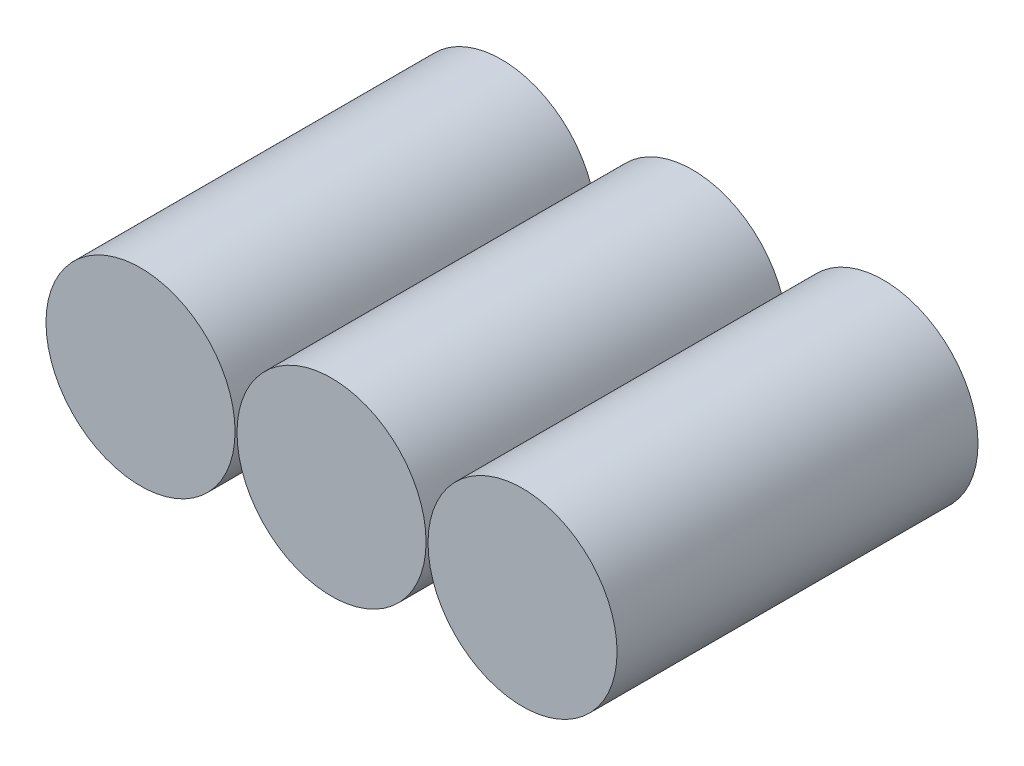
ISO-10303-21;
HEADER;
FILE_DESCRIPTION(('STEP AP214'),'2;1');
FILE_NAME('part.step','',(''),(''),'','','');
FILE_SCHEMA(('AUTOMOTIVE_DESIGN { 1 0 10303 214 1 1 1 1 }'));
ENDSEC;
DATA;
#1=APPLICATION_CONTEXT('core data for automotive mechanical design processes');
#2=APPLICATION_PROTOCOL_DEFINITION('international standard','automotive_design',2000,#1);
#3=PRODUCT_CONTEXT('',#1,'mechanical');
#4=PRODUCT('Part','Part','',(#3));
#5=PRODUCT_RELATED_PRODUCT_CATEGORY('part','',(#4));
#6=PRODUCT_DEFINITION_FORMATION('','',#4);
#7=PRODUCT_DEFINITION_CONTEXT('part definition',#1,'design');
#8=PRODUCT_DEFINITION('design','',#6,#7);
#9=PRODUCT_DEFINITION_SHAPE('','',#8);
#10=(LENGTH_UNIT() NAMED_UNIT(*) SI_UNIT(.MILLI.,.METRE.));
#11=(NAMED_UNIT(*) PLANE_ANGLE_UNIT() SI_UNIT($,.RADIAN.));
#12=(NAMED_UNIT(*) SI_UNIT($,.STERADIAN.) SOLID_ANGLE_UNIT());
#13=UNCERTAINTY_MEASURE_WITH_UNIT(LENGTH_MEASURE(1.E-05),#10,'distance_accuracy_value','');
#14=(GEOMETRIC_REPRESENTATION_CONTEXT(3) GLOBAL_UNCERTAINTY_ASSIGNED_CONTEXT((#13)) GLOBAL_UNIT_ASSIGNED_CONTEXT((#10,
#11,#12)) REPRESENTATION_CONTEXT('',''));
#15=CARTESIAN_POINT('',(0.,0.,0.));
#16=DIRECTION('',(0.,0.,1.));
#17=DIRECTION('',(1.,0.,0.));
#18=AXIS2_PLACEMENT_3D('',#15,#16,#17);
#19=CARTESIAN_POINT('',(44.4533334,0.,21.));
#20=DIRECTION('',(0.,0.,-1.));
#21=DIRECTION('',(-1.,0.,0.));
#22=AXIS2_PLACEMENT_3D('',#19,#20,#21);
#23=CYLINDRICAL_SURFACE('',#22,11.);
#24=CARTESIAN_POINT('',(44.4533334,0.,21.));
#25=DIRECTION('',(0.,0.,1.));
#26=DIRECTION('',(1.,0.,0.));
#27=AXIS2_PLACEMENT_3D('',#24,#25,#26);
#28=CIRCLE('',#27,11.);
#29=CARTESIAN_POINT('',(33.4533334,0.,21.));
#30=VERTEX_POINT('',#29);
#31=EDGE_CURVE('E11',#30,#30,#28,.T.);
#32=CARTESIAN_POINT('',(44.4533334,0.,-21.));
#33=DIRECTION('',(0.,0.,1.));
#34=DIRECTION('',(1.,0.,0.));
#35=AXIS2_PLACEMENT_3D('',#32,#33,#34);
#36=CIRCLE('',#35,11.);
#37=CARTESIAN_POINT('',(33.4533334,0.,-21.));
#38=VERTEX_POINT('',#37);
#39=EDGE_CURVE('E46',#38,#38,#36,.T.);
#40=CARTESIAN_POINT('',(33.4533334,0.,21.));
#41=CARTESIAN_POINT('',(33.4533334,0.,20.5625));
#42=CARTESIAN_POINT('',(33.4533334,0.,20.125));
#43=CARTESIAN_POINT('',(33.4533334,0.,19.25));
#44=CARTESIAN_POINT('',(33.4533334,0.,18.8125));
#45=CARTESIAN_POINT('',(33.4533334,0.,17.9375));
#46=CARTESIAN_POINT('',(33.4533334,0.,17.5));
#47=CARTESIAN_POINT('',(33.4533334,0.,16.625));
#48=CARTESIAN_POINT('',(33.4533334,0.,16.1875));
#49=CARTESIAN_POINT('',(33.4533334,0.,15.3125));
#50=CARTESIAN_POINT('',(33.4533334,0.,14.875));
#51=CARTESIAN_POINT('',(33.4533334,0.,14.));
#52=CARTESIAN_POINT('',(33.4533334,0.,13.5625));
#53=CARTESIAN_POINT('',(33.4533334,0.,12.6875));
#54=CARTESIAN_POINT('',(33.4533334,0.,12.25));
#55=CARTESIAN_POINT('',(33.4533334,0.,11.375));
#56=CARTESIAN_POINT('',(33.4533334,0.,10.9375));
#57=CARTESIAN_POINT('',(33.4533334,0.,10.0625));
#58=CARTESIAN_POINT('',(33.4533334,0.,9.625));
#59=CARTESIAN_POINT('',(33.4533334,0.,8.75));
#60=CARTESIAN_POINT('',(33.4533334,0.,8.3125));
#61=CARTESIAN_POINT('',(33.4533334,0.,7.4375));
#62=CARTESIAN_POINT('',(33.4533334,0.,7.));
#63=CARTESIAN_POINT('',(33.4533334,0.,6.125));
#64=CARTESIAN_POINT('',(33.4533334,0.,5.6875));
#65=CARTESIAN_POINT('',(33.4533334,0.,4.8125));
#66=CARTESIAN_POINT('',(33.4533334,0.,4.375));
#67=CARTESIAN_POINT('',(33.4533334,0.,3.5));
#68=CARTESIAN_POINT('',(33.4533334,0.,3.0625));
#69=CARTESIAN_POINT('',(33.4533334,0.,2.1875));
#70=CARTESIAN_POINT('',(33.4533334,0.,1.75));
#71=CARTESIAN_POINT('',(33.4533334,0.,0.875000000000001));
#72=CARTESIAN_POINT('',(33.4533334,0.,0.4375));
#73=CARTESIAN_POINT('',(33.4533334,0.,-0.4375));
#74=CARTESIAN_POINT('',(33.4533334,0.,-0.875000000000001));
#75=CARTESIAN_POINT('',(33.4533334,0.,-1.75));
#76=CARTESIAN_POINT('',(33.4533334,0.,-2.1875));
#77=CARTESIAN_POINT('',(33.4533334,0.,-3.0625));
#78=CARTESIAN_POINT('',(33.4533334,0.,-3.5));
#79=CARTESIAN_POINT('',(33.4533334,0.,-4.375));
#80=CARTESIAN_POINT('',(33.4533334,0.,-4.8125));
#81=CARTESIAN_POINT('',(33.4533334,0.,-5.6875));
#82=CARTESIAN_POINT('',(33.4533334,0.,-6.125));
#83=CARTESIAN_POINT('',(33.4533334,0.,-7.));
#84=CARTESIAN_POINT('',(33.4533334,0.,-7.4375));
#85=CARTESIAN_POINT('',(33.4533334,0.,-8.3125));
#86=CARTESIAN_POINT('',(33.4533334,0.,-8.75));
#87=CARTESIAN_POINT('',(33.4533334,0.,-9.625));
#88=CARTESIAN_POINT('',(33.4533334,0.,-10.0625));
#89=CARTESIAN_POINT('',(33.4533334,0.,-10.9375));
#90=CARTESIAN_POINT('',(33.4533334,0.,-11.375));
#91=CARTESIAN_POINT('',(33.4533334,0.,-12.25));
#92=CARTESIAN_POINT('',(33.4533334,0.,-12.6875));
#93=CARTESIAN_POINT('',(33.4533334,0.,-13.5625));
#94=CARTESIAN_POINT('',(33.4533334,0.,-14.));
#95=CARTESIAN_POINT('',(33.4533334,0.,-14.875));
#96=CARTESIAN_POINT('',(33.4533334,0.,-15.3125));
#97=CARTESIAN_POINT('',(33.4533334,0.,-16.1875));
#98=CARTESIAN_POINT('',(33.4533334,0.,-16.625));
#99=CARTESIAN_POINT('',(33.4533334,0.,-17.5));
#100=CARTESIAN_POINT('',(33.4533334,0.,-17.9375));
#101=CARTESIAN_POINT('',(33.4533334,0.,-18.8125));
#102=CARTESIAN_POINT('',(33.4533334,0.,-19.25));
#103=CARTESIAN_POINT('',(33.4533334,0.,-20.125));
#104=CARTESIAN_POINT('',(33.4533334,0.,-20.5625));
#105=CARTESIAN_POINT('',(33.4533334,0.,-21.));
#106=B_SPLINE_CURVE_WITH_KNOTS('',3,(#40,#41,#42,#43,#44,#45,#46,#47,#48,#49,#50,#51,#52,#53,
#54,#55,#56,#57,#58,#59,#60,#61,#62,#63,#64,#65,#66,#67,#68,#69,#70,#71,#72,#73,#74,#75,#76,#77,
#78,#79,#80,#81,#82,#83,#84,#85,#86,#87,#88,#89,#90,#91,#92,#93,#94,#95,#96,#97,#98,#99,#100,
#101,#102,#103,#104,#105),.UNSPECIFIED.,.F.,.F.,(4,2,2,2,2,2,2,2,2,2,2,2,2,2,2,2,2,2,2,2,2,2,2,
2,2,2,2,2,2,2,2,2,4),(0.,1.3125,2.625,3.9375,5.25,6.5625,7.875,9.1875,10.5,11.8125,13.125,
14.4375,15.75,17.0625,18.375,19.6875,21.,22.3125,23.625,24.9375,26.25,27.5625,28.875,30.1875,
31.5,32.8125,34.125,35.4375,36.75,38.0625,39.375,40.6875,42.),.UNSPECIFIED.);
#107=EDGE_CURVE('BSEAM40',#30,#38,#106,.T.);
#108=ORIENTED_EDGE('',*,*,#31,.F.);
#109=ORIENTED_EDGE('',*,*,#39,.T.);
#110=ORIENTED_EDGE('',*,*,#107,.T.);
#111=ORIENTED_EDGE('',*,*,#107,.F.);
#112=EDGE_LOOP('',(#108,#110,#109,#111));
#113=FACE_BOUND('',#112,.T.);
#114=ADVANCED_FACE('F40',(#113),#23,.T.);
#115=CARTESIAN_POINT('',(44.4533334,0.,21.));
#116=DIRECTION('',(0.,0.,1.));
#117=DIRECTION('',(1.,0.,0.));
#118=AXIS2_PLACEMENT_3D('',#115,#116,#117);
#119=PLANE('',#118);
#120=ORIENTED_EDGE('',*,*,#31,.T.);
#121=EDGE_LOOP('',(#120));
#122=FACE_BOUND('',#121,.T.);
#123=ADVANCED_FACE('F55',(#122),#119,.T.);
#124=CARTESIAN_POINT('',(44.4533334,0.,-21.));
#125=DIRECTION('',(0.,0.,1.));
#126=DIRECTION('',(1.,0.,0.));
#127=AXIS2_PLACEMENT_3D('',#124,#125,#126);
#128=PLANE('',#127);
#129=ORIENTED_EDGE('',*,*,#39,.F.);
#130=EDGE_LOOP('',(#129));
#131=FACE_BOUND('',#130,.T.);
#132=ADVANCED_FACE('F53',(#131),#128,.F.);
#133=CLOSED_SHELL('',(#114,#123,#132));
#134=MANIFOLD_SOLID_BREP('B2',#133);
#135=CARTESIAN_POINT('',(22.2266667,0.,21.));
#136=DIRECTION('',(0.,0.,-1.));
#137=DIRECTION('',(-1.,0.,0.));
#138=AXIS2_PLACEMENT_3D('',#135,#136,#137);
#139=CYLINDRICAL_SURFACE('',#138,11.);
#140=CARTESIAN_POINT('',(22.2266667,0.,21.));
#141=DIRECTION('',(0.,0.,1.));
#142=DIRECTION('',(1.,0.,0.));
#143=AXIS2_PLACEMENT_3D('',#140,#141,#142);
#144=CIRCLE('',#143,11.);
#145=CARTESIAN_POINT('',(11.2266667,0.,21.));
#146=VERTEX_POINT('',#145);
#147=EDGE_CURVE('E39',#146,#146,#144,.T.);
#148=CARTESIAN_POINT('',(22.2266667,0.,-21.));
#149=DIRECTION('',(0.,0.,1.));
#150=DIRECTION('',(1.,0.,0.));
#151=AXIS2_PLACEMENT_3D('',#148,#149,#150);
#152=CIRCLE('',#151,11.);
#153=CARTESIAN_POINT('',(11.2266667,0.,-21.));
#154=VERTEX_POINT('',#153);
#155=EDGE_CURVE('E94',#154,#154,#152,.T.);
#156=CARTESIAN_POINT('',(11.2266667,0.,21.));
#157=CARTESIAN_POINT('',(11.2266667,0.,20.5625));
#158=CARTESIAN_POINT('',(11.2266667,0.,20.125));
#159=CARTESIAN_POINT('',(11.2266667,0.,19.25));
#160=CARTESIAN_POINT('',(11.2266667,0.,18.8125));
#161=CARTESIAN_POINT('',(11.2266667,0.,17.9375));
#162=CARTESIAN_POINT('',(11.2266667,0.,17.5));
#163=CARTESIAN_POINT('',(11.2266667,0.,16.625));
#164=CARTESIAN_POINT('',(11.2266667,0.,16.1875));
#165=CARTESIAN_POINT('',(11.2266667,0.,15.3125));
#166=CARTESIAN_POINT('',(11.2266667,0.,14.875));
#167=CARTESIAN_POINT('',(11.2266667,0.,14.));
#168=CARTESIAN_POINT('',(11.2266667,0.,13.5625));
#169=CARTESIAN_POINT('',(11.2266667,0.,12.6875));
#170=CARTESIAN_POINT('',(11.2266667,0.,12.25));
#171=CARTESIAN_POINT('',(11.2266667,0.,11.375));
#172=CARTESIAN_POINT('',(11.2266667,0.,10.9375));
#173=CARTESIAN_POINT('',(11.2266667,0.,10.0625));
#174=CARTESIAN_POINT('',(11.2266667,0.,9.625));
#175=CARTESIAN_POINT('',(11.2266667,0.,8.75));
#176=CARTESIAN_POINT('',(11.2266667,0.,8.3125));
#177=CARTESIAN_POINT('',(11.2266667,0.,7.4375));
#178=CARTESIAN_POINT('',(11.2266667,0.,7.));
#179=CARTESIAN_POINT('',(11.2266667,0.,6.125));
#180=CARTESIAN_POINT('',(11.2266667,0.,5.6875));
#181=CARTESIAN_POINT('',(11.2266667,0.,4.8125));
#182=CARTESIAN_POINT('',(11.2266667,0.,4.375));
#183=CARTESIAN_POINT('',(11.2266667,0.,3.5));
#184=CARTESIAN_POINT('',(11.2266667,0.,3.0625));
#185=CARTESIAN_POINT('',(11.2266667,0.,2.1875));
#186=CARTESIAN_POINT('',(11.2266667,0.,1.75));
#187=CARTESIAN_POINT('',(11.2266667,0.,0.875000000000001));
#188=CARTESIAN_POINT('',(11.2266667,0.,0.4375));
#189=CARTESIAN_POINT('',(11.2266667,0.,-0.4375));
#190=CARTESIAN_POINT('',(11.2266667,0.,-0.875000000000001));
#191=CARTESIAN_POINT('',(11.2266667,0.,-1.75));
#192=CARTESIAN_POINT('',(11.2266667,0.,-2.1875));
#193=CARTESIAN_POINT('',(11.2266667,0.,-3.0625));
#194=CARTESIAN_POINT('',(11.2266667,0.,-3.5));
#195=CARTESIAN_POINT('',(11.2266667,0.,-4.375));
#196=CARTESIAN_POINT('',(11.2266667,0.,-4.8125));
#197=CARTESIAN_POINT('',(11.2266667,0.,-5.6875));
#198=CARTESIAN_POINT('',(11.2266667,0.,-6.125));
#199=CARTESIAN_POINT('',(11.2266667,0.,-7.));
#200=CARTESIAN_POINT('',(11.2266667,0.,-7.4375));
#201=CARTESIAN_POINT('',(11.2266667,0.,-8.3125));
#202=CARTESIAN_POINT('',(11.2266667,0.,-8.75));
#203=CARTESIAN_POINT('',(11.2266667,0.,-9.625));
#204=CARTESIAN_POINT('',(11.2266667,0.,-10.0625));
#205=CARTESIAN_POINT('',(11.2266667,0.,-10.9375));
#206=CARTESIAN_POINT('',(11.2266667,0.,-11.375));
#207=CARTESIAN_POINT('',(11.2266667,0.,-12.25));
#208=CARTESIAN_POINT('',(11.2266667,0.,-12.6875));
#209=CARTESIAN_POINT('',(11.2266667,0.,-13.5625));
#210=CARTESIAN_POINT('',(11.2266667,0.,-14.));
#211=CARTESIAN_POINT('',(11.2266667,0.,-14.875));
#212=CARTESIAN_POINT('',(11.2266667,0.,-15.3125));
#213=CARTESIAN_POINT('',(11.2266667,0.,-16.1875));
#214=CARTESIAN_POINT('',(11.2266667,0.,-16.625));
#215=CARTESIAN_POINT('',(11.2266667,0.,-17.5));
#216=CARTESIAN_POINT('',(11.2266667,0.,-17.9375));
#217=CARTESIAN_POINT('',(11.2266667,0.,-18.8125));
#218=CARTESIAN_POINT('',(11.2266667,0.,-19.25));
#219=CARTESIAN_POINT('',(11.2266667,0.,-20.125));
#220=CARTESIAN_POINT('',(11.2266667,0.,-20.5625));
#221=CARTESIAN_POINT('',(11.2266667,0.,-21.));
#222=B_SPLINE_CURVE_WITH_KNOTS('',3,(#156,#157,#158,#159,#160,#161,#162,#163,#164,#165,#166,
#167,#168,#169,#170,#171,#172,#173,#174,#175,#176,#177,#178,#179,#180,#181,#182,#183,#184,#185,
#186,#187,#188,#189,#190,#191,#192,#193,#194,#195,#196,#197,#198,#199,#200,#201,#202,#203,#204,
#205,#206,#207,#208,#209,#210,#211,#212,#213,#214,#215,#216,#217,#218,#219,#220,#221),
.UNSPECIFIED.,.F.,.F.,(4,2,2,2,2,2,2,2,2,2,2,2,2,2,2,2,2,2,2,2,2,2,2,2,2,2,2,2,2,2,2,2,4),(0.,
1.3125,2.625,3.9375,5.25,6.5625,7.875,9.1875,10.5,11.8125,13.125,14.4375,15.75,17.0625,18.375,
19.6875,21.,22.3125,23.625,24.9375,26.25,27.5625,28.875,30.1875,31.5,32.8125,34.125,35.4375,
36.75,38.0625,39.375,40.6875,42.),.UNSPECIFIED.);
#223=EDGE_CURVE('BSEAM88',#146,#154,#222,.T.);
#224=ORIENTED_EDGE('',*,*,#147,.F.);
#225=ORIENTED_EDGE('',*,*,#155,.T.);
#226=ORIENTED_EDGE('',*,*,#223,.T.);
#227=ORIENTED_EDGE('',*,*,#223,.F.);
#228=EDGE_LOOP('',(#224,#226,#225,#227));
#229=FACE_BOUND('',#228,.T.);
#230=ADVANCED_FACE('F88',(#229),#139,.T.);
#231=CARTESIAN_POINT('',(22.2266667,0.,21.));
#232=DIRECTION('',(0.,0.,1.));
#233=DIRECTION('',(1.,0.,0.));
#234=AXIS2_PLACEMENT_3D('',#231,#232,#233);
#235=PLANE('',#234);
#236=ORIENTED_EDGE('',*,*,#147,.T.);
#237=EDGE_LOOP('',(#236));
#238=FACE_BOUND('',#237,.T.);
#239=ADVANCED_FACE('F103',(#238),#235,.T.);
#240=CARTESIAN_POINT('',(22.2266667,0.,-21.));
#241=DIRECTION('',(0.,0.,1.));
#242=DIRECTION('',(1.,0.,0.));
#243=AXIS2_PLACEMENT_3D('',#240,#241,#242);
#244=PLANE('',#243);
#245=ORIENTED_EDGE('',*,*,#155,.F.);
#246=EDGE_LOOP('',(#245));
#247=FACE_BOUND('',#246,.T.);
#248=ADVANCED_FACE('F101',(#247),#244,.F.);
#249=CLOSED_SHELL('',(#230,#239,#248));
#250=MANIFOLD_SOLID_BREP('B6',#249);
#251=CARTESIAN_POINT('',(0.,0.,21.));
#252=DIRECTION('',(0.,0.,-1.));
#253=DIRECTION('',(-1.,0.,0.));
#254=AXIS2_PLACEMENT_3D('',#251,#252,#253);
#255=CYLINDRICAL_SURFACE('',#254,11.);
#256=CARTESIAN_POINT('',(0.,0.,21.));
#257=DIRECTION('',(0.,0.,1.));
#258=DIRECTION('',(1.,0.,0.));
#259=AXIS2_PLACEMENT_3D('',#256,#257,#258);
#260=CIRCLE('',#259,11.);
#261=CARTESIAN_POINT('',(-11.,0.,21.));
#262=VERTEX_POINT('',#261);
#263=EDGE_CURVE('E87',#262,#262,#260,.T.);
#264=CARTESIAN_POINT('',(0.,0.,-21.));
#265=DIRECTION('',(0.,0.,1.));
#266=DIRECTION('',(1.,0.,0.));
#267=AXIS2_PLACEMENT_3D('',#264,#265,#266);
#268=CIRCLE('',#267,11.);
#269=CARTESIAN_POINT('',(-11.,0.,-21.));
#270=VERTEX_POINT('',#269);
#271=EDGE_CURVE('E135',#270,#270,#268,.T.);
#272=CARTESIAN_POINT('',(-11.,0.,21.));
#273=CARTESIAN_POINT('',(-11.,0.,20.5625));
#274=CARTESIAN_POINT('',(-11.,0.,20.125));
#275=CARTESIAN_POINT('',(-11.,0.,19.25));
#276=CARTESIAN_POINT('',(-11.,0.,18.8125));
#277=CARTESIAN_POINT('',(-11.,0.,17.9375));
#278=CARTESIAN_POINT('',(-11.,0.,17.5));
#279=CARTESIAN_POINT('',(-11.,0.,16.625));
#280=CARTESIAN_POINT('',(-11.,0.,16.1875));
#281=CARTESIAN_POINT('',(-11.,0.,15.3125));
#282=CARTESIAN_POINT('',(-11.,0.,14.875));
#283=CARTESIAN_POINT('',(-11.,0.,14.));
#284=CARTESIAN_POINT('',(-11.,0.,13.5625));
#285=CARTESIAN_POINT('',(-11.,0.,12.6875));
#286=CARTESIAN_POINT('',(-11.,0.,12.25));
#287=CARTESIAN_POINT('',(-11.,0.,11.375));
#288=CARTESIAN_POINT('',(-11.,0.,10.9375));
#289=CARTESIAN_POINT('',(-11.,0.,10.0625));
#290=CARTESIAN_POINT('',(-11.,0.,9.625));
#291=CARTESIAN_POINT('',(-11.,0.,8.75));
#292=CARTESIAN_POINT('',(-11.,0.,8.3125));
#293=CARTESIAN_POINT('',(-11.,0.,7.4375));
#294=CARTESIAN_POINT('',(-11.,0.,7.));
#295=CARTESIAN_POINT('',(-11.,0.,6.125));
#296=CARTESIAN_POINT('',(-11.,0.,5.6875));
#297=CARTESIAN_POINT('',(-11.,0.,4.8125));
#298=CARTESIAN_POINT('',(-11.,0.,4.375));
#299=CARTESIAN_POINT('',(-11.,0.,3.5));
#300=CARTESIAN_POINT('',(-11.,0.,3.0625));
#301=CARTESIAN_POINT('',(-11.,0.,2.1875));
#302=CARTESIAN_POINT('',(-11.,0.,1.75));
#303=CARTESIAN_POINT('',(-11.,0.,0.875000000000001));
#304=CARTESIAN_POINT('',(-11.,0.,0.4375));
#305=CARTESIAN_POINT('',(-11.,0.,-0.4375));
#306=CARTESIAN_POINT('',(-11.,0.,-0.875000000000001));
#307=CARTESIAN_POINT('',(-11.,0.,-1.75));
#308=CARTESIAN_POINT('',(-11.,0.,-2.1875));
#309=CARTESIAN_POINT('',(-11.,0.,-3.0625));
#310=CARTESIAN_POINT('',(-11.,0.,-3.5));
#311=CARTESIAN_POINT('',(-11.,0.,-4.375));
#312=CARTESIAN_POINT('',(-11.,0.,-4.8125));
#313=CARTESIAN_POINT('',(-11.,0.,-5.6875));
#314=CARTESIAN_POINT('',(-11.,0.,-6.125));
#315=CARTESIAN_POINT('',(-11.,0.,-7.));
#316=CARTESIAN_POINT('',(-11.,0.,-7.4375));
#317=CARTESIAN_POINT('',(-11.,0.,-8.3125));
#318=CARTESIAN_POINT('',(-11.,0.,-8.75));
#319=CARTESIAN_POINT('',(-11.,0.,-9.625));
#320=CARTESIAN_POINT('',(-11.,0.,-10.0625));
#321=CARTESIAN_POINT('',(-11.,0.,-10.9375));
#322=CARTESIAN_POINT('',(-11.,0.,-11.375));
#323=CARTESIAN_POINT('',(-11.,0.,-12.25));
#324=CARTESIAN_POINT('',(-11.,0.,-12.6875));
#325=CARTESIAN_POINT('',(-11.,0.,-13.5625));
#326=CARTESIAN_POINT('',(-11.,0.,-14.));
#327=CARTESIAN_POINT('',(-11.,0.,-14.875));
#328=CARTESIAN_POINT('',(-11.,0.,-15.3125));
#329=CARTESIAN_POINT('',(-11.,0.,-16.1875));
#330=CARTESIAN_POINT('',(-11.,0.,-16.625));
#331=CARTESIAN_POINT('',(-11.,0.,-17.5));
#332=CARTESIAN_POINT('',(-11.,0.,-17.9375));
#333=CARTESIAN_POINT('',(-11.,0.,-18.8125));
#334=CARTESIAN_POINT('',(-11.,0.,-19.25));
#335=CARTESIAN_POINT('',(-11.,0.,-20.125));
#336=CARTESIAN_POINT('',(-11.,0.,-20.5625));
#337=CARTESIAN_POINT('',(-11.,0.,-21.));
#338=B_SPLINE_CURVE_WITH_KNOTS('',3,(#272,#273,#274,#275,#276,#277,#278,#279,#280,#281,#282,
#283,#284,#285,#286,#287,#288,#289,#290,#291,#292,#293,#294,#295,#296,#297,#298,#299,#300,#301,
#302,#303,#304,#305,#306,#307,#308,#309,#310,#311,#312,#313,#314,#315,#316,#317,#318,#319,#320,
#321,#322,#323,#324,#325,#326,#327,#328,#329,#330,#331,#332,#333,#334,#335,#336,#337),
.UNSPECIFIED.,.F.,.F.,(4,2,2,2,2,2,2,2,2,2,2,2,2,2,2,2,2,2,2,2,2,2,2,2,2,2,2,2,2,2,2,2,4),(0.,
1.3125,2.625,3.9375,5.25,6.5625,7.875,9.1875,10.5,11.8125,13.125,14.4375,15.75,17.0625,18.375,
19.6875,21.,22.3125,23.625,24.9375,26.25,27.5625,28.875,30.1875,31.5,32.8125,34.125,35.4375,
36.75,38.0625,39.375,40.6875,42.),.UNSPECIFIED.);
#339=EDGE_CURVE('BSEAM129',#262,#270,#338,.T.);
#340=ORIENTED_EDGE('',*,*,#263,.F.);
#341=ORIENTED_EDGE('',*,*,#271,.T.);
#342=ORIENTED_EDGE('',*,*,#339,.T.);
#343=ORIENTED_EDGE('',*,*,#339,.F.);
#344=EDGE_LOOP('',(#340,#342,#341,#343));
#345=FACE_BOUND('',#344,.T.);
#346=ADVANCED_FACE('F129',(#345),#255,.T.);
#347=CARTESIAN_POINT('',(0.,0.,21.));
#348=DIRECTION('',(0.,0.,1.));
#349=DIRECTION('',(1.,0.,0.));
#350=AXIS2_PLACEMENT_3D('',#347,#348,#349);
#351=PLANE('',#350);
#352=ORIENTED_EDGE('',*,*,#263,.T.);
#353=EDGE_LOOP('',(#352));
#354=FACE_BOUND('',#353,.T.);
#355=ADVANCED_FACE('F144',(#354),#351,.T.);
#356=CARTESIAN_POINT('',(0.,0.,-21.));
#357=DIRECTION('',(0.,0.,1.));
#358=DIRECTION('',(1.,0.,0.));
#359=AXIS2_PLACEMENT_3D('',#356,#357,#358);
#360=PLANE('',#359);
#361=ORIENTED_EDGE('',*,*,#271,.F.);
#362=EDGE_LOOP('',(#361));
#363=FACE_BOUND('',#362,.T.);
#364=ADVANCED_FACE('F142',(#363),#360,.F.);
#365=CLOSED_SHELL('',(#346,#355,#364));
#366=MANIFOLD_SOLID_BREP('B34',#365);
#367=ADVANCED_BREP_SHAPE_REPRESENTATION('',(#18,#134,#250,#366),#14);
#368=SHAPE_DEFINITION_REPRESENTATION(#9,#367);
ENDSEC;
END-ISO-10303-21;
